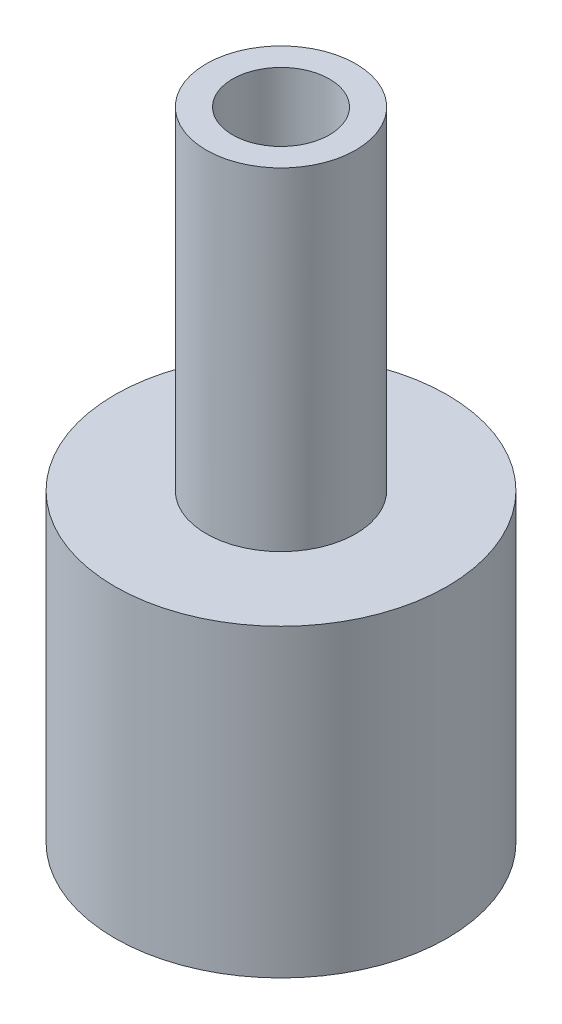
from build123d import *

# Parameters (mm, degrees)
SKETCH1_R               = 1.35
BOSS_EXTRUDE1_DEPTH     = 5.75
SKETCH2_R               = 3
BOSS_EXTRUDE2_DEPTH     = 5.5
CUT_EXTRUDE1_DEPTH      = 13.257650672
CUT_EXTRUDE1_DEPTH_BACK = 13.257650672
SKETCH3_R               = 0.875


with BuildPart() as part:
    # Sketch1 → Boss-Extrude1 (new, symmetric)
    with BuildSketch(Plane(origin=(0, 0, 0), x_dir=(1, 0, 0), z_dir=(0, 1, 0))):
        with Locations(Location((0, 0, 0), (0, 0, 270))):
            Circle(SKETCH1_R)
    extrude(amount=BOSS_EXTRUDE1_DEPTH, both=True)

    # Sketch2 → Boss-Extrude2 (add)
    with BuildSketch(Plane.XZ.offset(5.75)):
        with Locations(Location((0, 0, 0), (0, 0, 270))):
            Circle(SKETCH2_R)
    extrude(amount=-BOSS_EXTRUDE2_DEPTH)

    # Sketch3 → Cut-Extrude1 (cut, two sides: drawn at the far end of the back side and taken through both)
    with BuildSketch(Plane.XZ.offset(5.75).offset(-CUT_EXTRUDE1_DEPTH_BACK)):
        with Locations(Location((0, 0, 0), (0, 0, 270))):
            Circle(SKETCH3_R)
    extrude(amount=CUT_EXTRUDE1_DEPTH + CUT_EXTRUDE1_DEPTH_BACK, mode=Mode.SUBTRACT)


solid = part.part
